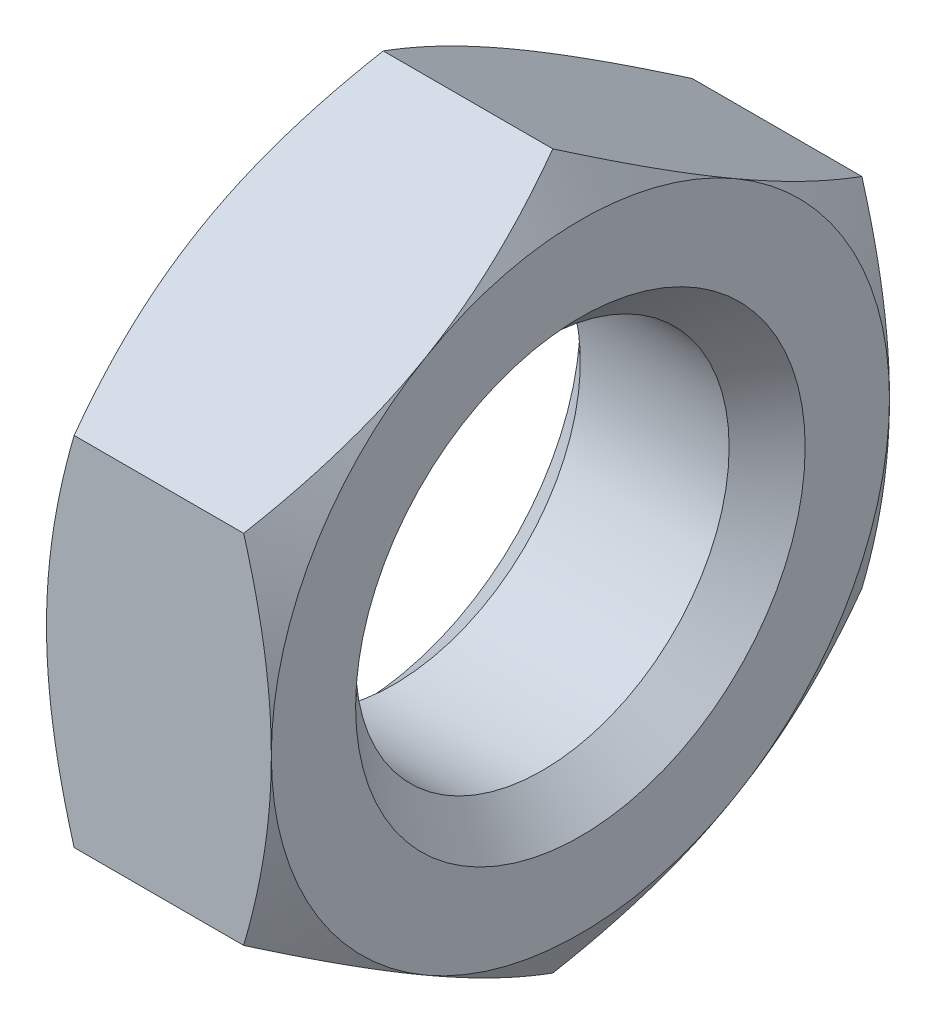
ISO-10303-21;
HEADER;
FILE_DESCRIPTION(('STEP AP214'),'2;1');
FILE_NAME('part.step','',(''),(''),'','','');
FILE_SCHEMA(('AUTOMOTIVE_DESIGN { 1 0 10303 214 1 1 1 1 }'));
ENDSEC;
DATA;
#1=APPLICATION_CONTEXT('core data for automotive mechanical design processes');
#2=APPLICATION_PROTOCOL_DEFINITION('international standard','automotive_design',2000,#1);
#3=PRODUCT_CONTEXT('',#1,'mechanical');
#4=PRODUCT('Part','Part','',(#3));
#5=PRODUCT_RELATED_PRODUCT_CATEGORY('part','',(#4));
#6=PRODUCT_DEFINITION_FORMATION('','',#4);
#7=PRODUCT_DEFINITION_CONTEXT('part definition',#1,'design');
#8=PRODUCT_DEFINITION('design','',#6,#7);
#9=PRODUCT_DEFINITION_SHAPE('','',#8);
#10=(LENGTH_UNIT() NAMED_UNIT(*) SI_UNIT(.MILLI.,.METRE.));
#11=(NAMED_UNIT(*) PLANE_ANGLE_UNIT() SI_UNIT($,.RADIAN.));
#12=(NAMED_UNIT(*) SI_UNIT($,.STERADIAN.) SOLID_ANGLE_UNIT());
#13=UNCERTAINTY_MEASURE_WITH_UNIT(LENGTH_MEASURE(1.E-05),#10,'distance_accuracy_value','');
#14=(GEOMETRIC_REPRESENTATION_CONTEXT(3) GLOBAL_UNCERTAINTY_ASSIGNED_CONTEXT((#13)) GLOBAL_UNIT_ASSIGNED_CONTEXT((#10,
#11,#12)) REPRESENTATION_CONTEXT('',''));
#15=CARTESIAN_POINT('',(0.,0.,0.));
#16=DIRECTION('',(0.,0.,1.));
#17=DIRECTION('',(1.,0.,0.));
#18=AXIS2_PLACEMENT_3D('',#15,#16,#17);
#19=CARTESIAN_POINT('',(2.,5.5,0.));
#20=DIRECTION('',(-1.,0.,0.));
#21=DIRECTION('',(0.,0.,1.));
#22=AXIS2_PLACEMENT_3D('',#19,#20,#21);
#23=PLANE('',#22);
#24=CARTESIAN_POINT('',(2.00000000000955,0.,0.));
#25=DIRECTION('',(1.,0.,0.));
#26=DIRECTION('',(0.,0.,-1.));
#27=AXIS2_PLACEMENT_3D('',#24,#25,#26);
#28=CIRCLE('',#27,3.99999999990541);
#29=CARTESIAN_POINT('',(2.00000000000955,0.,-3.99999999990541));
#30=VERTEX_POINT('',#29);
#31=EDGE_CURVE('E126',#30,#30,#28,.F.);
#32=ORIENTED_EDGE('',*,*,#31,.T.);
#33=EDGE_LOOP('',(#32));
#34=FACE_BOUND('',#33,.T.);
#35=CARTESIAN_POINT('',(2.00000000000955,0.,0.));
#36=DIRECTION('',(-1.,0.,0.));
#37=DIRECTION('',(0.,0.,1.));
#38=AXIS2_PLACEMENT_3D('',#35,#36,#37);
#39=CIRCLE('',#38,5.49999999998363);
#40=CARTESIAN_POINT('',(2.00000000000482,-4.76313972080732,2.7499999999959));
#41=VERTEX_POINT('',#40);
#42=CARTESIAN_POINT('',(2.00000000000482,0.,5.49999999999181));
#43=VERTEX_POINT('',#42);
#44=EDGE_CURVE('E129',#41,#43,#39,.T.);
#45=ORIENTED_EDGE('',*,*,#44,.F.);
#46=CARTESIAN_POINT('',(2.00000000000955,0.,0.));
#47=DIRECTION('',(-1.,0.,0.));
#48=DIRECTION('',(0.,0.,1.));
#49=AXIS2_PLACEMENT_3D('',#46,#47,#48);
#50=CIRCLE('',#49,5.49999999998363);
#51=CARTESIAN_POINT('',(2.00000000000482,-4.76313972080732,-2.74999999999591));
#52=VERTEX_POINT('',#51);
#53=EDGE_CURVE('E20',#52,#41,#50,.T.);
#54=ORIENTED_EDGE('',*,*,#53,.F.);
#55=CARTESIAN_POINT('',(2.00000000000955,0.,0.));
#56=DIRECTION('',(-1.,0.,0.));
#57=DIRECTION('',(0.,0.,1.));
#58=AXIS2_PLACEMENT_3D('',#55,#56,#57);
#59=CIRCLE('',#58,5.49999999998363);
#60=CARTESIAN_POINT('',(2.00000000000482,0.,-5.49999999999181));
#61=VERTEX_POINT('',#60);
#62=EDGE_CURVE('E104',#61,#52,#59,.T.);
#63=ORIENTED_EDGE('',*,*,#62,.F.);
#64=CARTESIAN_POINT('',(2.00000000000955,0.,0.));
#65=DIRECTION('',(-1.,0.,0.));
#66=DIRECTION('',(0.,0.,1.));
#67=AXIS2_PLACEMENT_3D('',#64,#65,#66);
#68=CIRCLE('',#67,5.49999999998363);
#69=CARTESIAN_POINT('',(2.00000000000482,4.76313972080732,-2.74999999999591));
#70=VERTEX_POINT('',#69);
#71=EDGE_CURVE('E424',#70,#61,#68,.T.);
#72=ORIENTED_EDGE('',*,*,#71,.F.);
#73=CARTESIAN_POINT('',(2.00000000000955,0.,0.));
#74=DIRECTION('',(-1.,0.,0.));
#75=DIRECTION('',(0.,0.,1.));
#76=AXIS2_PLACEMENT_3D('',#73,#74,#75);
#77=CIRCLE('',#76,5.49999999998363);
#78=CARTESIAN_POINT('',(2.00000000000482,4.76313972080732,2.74999999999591));
#79=VERTEX_POINT('',#78);
#80=EDGE_CURVE('E136',#79,#70,#77,.T.);
#81=ORIENTED_EDGE('',*,*,#80,.F.);
#82=CARTESIAN_POINT('',(2.00000000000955,0.,0.));
#83=DIRECTION('',(-1.,0.,0.));
#84=DIRECTION('',(0.,0.,1.));
#85=AXIS2_PLACEMENT_3D('',#82,#83,#84);
#86=CIRCLE('',#85,5.49999999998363);
#87=EDGE_CURVE('E131',#43,#79,#86,.T.);
#88=ORIENTED_EDGE('',*,*,#87,.F.);
#89=EDGE_LOOP('',(#45,#54,#63,#72,#81,#88));
#90=FACE_BOUND('',#89,.T.);
#91=ADVANCED_FACE('F17',(#34,#90),#23,.F.);
#92=CARTESIAN_POINT('',(1.50581237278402,0.,0.));
#93=DIRECTION('',(-1.,0.,0.));
#94=DIRECTION('',(0.,0.,1.));
#95=AXIS2_PLACEMENT_3D('',#92,#93,#94);
#96=CONICAL_SURFACE('',#95,6.35595807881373,1.04719755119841);
#97=ORIENTED_EDGE('',*,*,#53,.T.);
#98=CARTESIAN_POINT('',(1.50875981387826,-6.35085296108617,-4.9636607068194E-13));
#99=CARTESIAN_POINT('',(1.58339480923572,-6.22161377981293,0.223848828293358));
#100=CARTESIAN_POINT('',(1.65177349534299,-6.0913396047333,0.449490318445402));
#101=CARTESIAN_POINT('',(1.77235807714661,-5.82964290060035,0.902762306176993));
#102=CARTESIAN_POINT('',(1.82464394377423,-5.69822949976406,1.13037699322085));
#103=CARTESIAN_POINT('',(1.88884211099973,-5.49986917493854,1.47394715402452));
#104=CARTESIAN_POINT('',(1.90787752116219,-5.43349849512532,1.5889045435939));
#105=CARTESIAN_POINT('',(1.94082821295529,-5.30043939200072,1.81936967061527));
#106=CARTESIAN_POINT('',(1.95474362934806,-5.23375097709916,1.934877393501));
#107=CARTESIAN_POINT('',(1.9772098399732,-5.09980973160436,2.16687043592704));
#108=CARTESIAN_POINT('',(1.98573335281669,-5.03255574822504,2.28335775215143));
#109=CARTESIAN_POINT('',(1.99714023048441,-4.89791551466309,2.51656147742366));
#110=CARTESIAN_POINT('',(2.00002247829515,-4.83052924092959,2.63327792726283));
#111=CARTESIAN_POINT('',(2.0000000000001,-4.76313972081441,2.75));
#112=B_SPLINE_CURVE_WITH_KNOTS('',3,(#98,#99,#100,#101,#102,#103,#104,#105,#106,#107,#108,#109,
#110,#111),.UNSPECIFIED.,.F.,.F.,(4,2,2,2,2,2,4),(0.,0.80744032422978,1.61080087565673,
2.01300823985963,2.41520501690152,2.81942084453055,3.22371670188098),.UNSPECIFIED.);
#113=CARTESIAN_POINT('',(1.50875981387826,-6.35085296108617,0.));
#114=VERTEX_POINT('',#113);
#115=EDGE_CURVE('E113',#114,#41,#112,.T.);
#116=ORIENTED_EDGE('',*,*,#115,.F.);
#117=CARTESIAN_POINT('',(2.0000000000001,-4.76313972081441,-2.75));
#118=CARTESIAN_POINT('',(2.00002247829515,-4.83052924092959,-2.63327792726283));
#119=CARTESIAN_POINT('',(1.99714023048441,-4.89791551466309,-2.51656147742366));
#120=CARTESIAN_POINT('',(1.98573335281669,-5.03255574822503,-2.28335775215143));
#121=CARTESIAN_POINT('',(1.9772098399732,-5.09980973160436,-2.16687043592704));
#122=CARTESIAN_POINT('',(1.95474362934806,-5.23375097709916,-1.934877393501));
#123=CARTESIAN_POINT('',(1.94082821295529,-5.30043939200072,-1.81936967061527));
#124=CARTESIAN_POINT('',(1.90787752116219,-5.43349849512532,-1.5889045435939));
#125=CARTESIAN_POINT('',(1.88884211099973,-5.49986917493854,-1.47394715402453));
#126=CARTESIAN_POINT('',(1.82464394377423,-5.69822949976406,-1.13037699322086));
#127=CARTESIAN_POINT('',(1.77235807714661,-5.82964290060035,-0.902762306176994));
#128=CARTESIAN_POINT('',(1.65177349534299,-6.0913396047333,-0.449490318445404));
#129=CARTESIAN_POINT('',(1.58339480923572,-6.22161377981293,-0.22384882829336));
#130=CARTESIAN_POINT('',(1.50875981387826,-6.35085296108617,4.95414001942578E-13));
#131=B_SPLINE_CURVE_WITH_KNOTS('',3,(#117,#118,#119,#120,#121,#122,#123,#124,#125,#126,#127,
#128,#129,#130),.UNSPECIFIED.,.F.,.F.,(4,2,2,2,2,2,4),(0.,0.404295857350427,0.808511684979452,
1.21070846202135,1.61291582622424,2.4162763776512,3.22371670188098),.UNSPECIFIED.);
#132=EDGE_CURVE('E115',#52,#114,#131,.T.);
#133=ORIENTED_EDGE('',*,*,#132,.F.);
#134=EDGE_LOOP('',(#97,#116,#133));
#135=FACE_BOUND('',#134,.T.);
#136=ADVANCED_FACE('F112',(#135),#96,.T.);
#137=CARTESIAN_POINT('',(1.50581237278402,0.,0.));
#138=DIRECTION('',(-1.,0.,0.));
#139=DIRECTION('',(0.,0.,1.));
#140=AXIS2_PLACEMENT_3D('',#137,#138,#139);
#141=CONICAL_SURFACE('',#140,6.35595807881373,1.04719755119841);
#142=ORIENTED_EDGE('',*,*,#62,.T.);
#143=CARTESIAN_POINT('',(1.50875981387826,-3.17542648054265,-5.5000000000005));
#144=CARTESIAN_POINT('',(1.58339480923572,-3.30466566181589,-5.27615117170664));
#145=CARTESIAN_POINT('',(1.65177349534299,-3.43493983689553,-5.0505096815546));
#146=CARTESIAN_POINT('',(1.77235807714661,-3.69663654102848,-4.59723769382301));
#147=CARTESIAN_POINT('',(1.82464394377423,-3.82804994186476,-4.36962300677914));
#148=CARTESIAN_POINT('',(1.88884211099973,-4.02641026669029,-4.02605284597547));
#149=CARTESIAN_POINT('',(1.90787752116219,-4.0927809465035,-3.9110954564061));
#150=CARTESIAN_POINT('',(1.94082821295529,-4.22584004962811,-3.68063032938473));
#151=CARTESIAN_POINT('',(1.95474362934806,-4.29252846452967,-3.565122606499));
#152=CARTESIAN_POINT('',(1.9772098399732,-4.42646971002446,-3.33312956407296));
#153=CARTESIAN_POINT('',(1.98573335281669,-4.49372369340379,-3.21664224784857));
#154=CARTESIAN_POINT('',(1.99714023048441,-4.62836392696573,-2.98343852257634));
#155=CARTESIAN_POINT('',(2.00002247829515,-4.69575020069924,-2.86672207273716));
#156=CARTESIAN_POINT('',(2.0000000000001,-4.76313972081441,-2.75));
#157=B_SPLINE_CURVE_WITH_KNOTS('',3,(#143,#144,#145,#146,#147,#148,#149,#150,#151,#152,#153,
#154,#155,#156),.UNSPECIFIED.,.F.,.F.,(4,2,2,2,2,2,4),(0.,0.807440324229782,1.61080087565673,
2.01300823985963,2.41520501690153,2.81942084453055,3.22371670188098),.UNSPECIFIED.);
#158=CARTESIAN_POINT('',(1.50875981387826,-3.17542648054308,-5.50000000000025));
#159=VERTEX_POINT('',#158);
#160=EDGE_CURVE('E140',#159,#52,#157,.T.);
#161=ORIENTED_EDGE('',*,*,#160,.F.);
#162=CARTESIAN_POINT('',(2.0000000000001,0.,-5.5));
#163=CARTESIAN_POINT('',(2.00002247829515,-0.134779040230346,-5.5));
#164=CARTESIAN_POINT('',(1.99714023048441,-0.269551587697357,-5.5));
#165=CARTESIAN_POINT('',(1.98573335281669,-0.538832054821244,-5.5));
#166=CARTESIAN_POINT('',(1.9772098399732,-0.673340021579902,-5.5));
#167=CARTESIAN_POINT('',(1.95474362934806,-0.941222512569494,-5.5));
#168=CARTESIAN_POINT('',(1.94082821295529,-1.07459934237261,-5.5));
#169=CARTESIAN_POINT('',(1.90787752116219,-1.34071754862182,-5.5));
#170=CARTESIAN_POINT('',(1.88884211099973,-1.47345890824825,-5.5));
#171=CARTESIAN_POINT('',(1.82464394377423,-1.8701795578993,-5.5));
#172=CARTESIAN_POINT('',(1.77235807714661,-2.13300635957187,-5.5));
#173=CARTESIAN_POINT('',(1.65177349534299,-2.65639976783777,-5.5));
#174=CARTESIAN_POINT('',(1.58339480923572,-2.91694811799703,-5.5));
#175=CARTESIAN_POINT('',(1.50875981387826,-3.17542648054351,-5.5));
#176=B_SPLINE_CURVE_WITH_KNOTS('',3,(#162,#163,#164,#165,#166,#167,#168,#169,#170,#171,#172,
#173,#174,#175),.UNSPECIFIED.,.F.,.F.,(4,2,2,2,2,2,4),(0.,0.404295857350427,0.808511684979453,
1.21070846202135,1.61291582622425,2.4162763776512,3.22371670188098),.UNSPECIFIED.);
#177=EDGE_CURVE('E294',#61,#159,#176,.T.);
#178=ORIENTED_EDGE('',*,*,#177,.F.);
#179=EDGE_LOOP('',(#142,#161,#178));
#180=FACE_BOUND('',#179,.T.);
#181=ADVANCED_FACE('F284',(#180),#141,.T.);
#182=CARTESIAN_POINT('',(1.50581237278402,0.,0.));
#183=DIRECTION('',(-1.,0.,0.));
#184=DIRECTION('',(0.,0.,1.));
#185=AXIS2_PLACEMENT_3D('',#182,#183,#184);
#186=CONICAL_SURFACE('',#185,6.35595807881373,1.04719755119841);
#187=ORIENTED_EDGE('',*,*,#71,.T.);
#188=CARTESIAN_POINT('',(1.50875981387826,3.17542648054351,-5.5));
#189=CARTESIAN_POINT('',(1.58339480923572,2.91694811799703,-5.5));
#190=CARTESIAN_POINT('',(1.65177349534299,2.65639976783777,-5.5));
#191=CARTESIAN_POINT('',(1.77235807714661,2.13300635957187,-5.5));
#192=CARTESIAN_POINT('',(1.82464394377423,1.8701795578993,-5.5));
#193=CARTESIAN_POINT('',(1.88884211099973,1.47345890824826,-5.5));
#194=CARTESIAN_POINT('',(1.90787752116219,1.34071754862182,-5.5));
#195=CARTESIAN_POINT('',(1.94082821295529,1.07459934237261,-5.5));
#196=CARTESIAN_POINT('',(1.95474362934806,0.941222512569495,-5.5));
#197=CARTESIAN_POINT('',(1.9772098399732,0.673340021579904,-5.5));
#198=CARTESIAN_POINT('',(1.98573335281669,0.538832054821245,-5.5));
#199=CARTESIAN_POINT('',(1.99714023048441,0.269551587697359,-5.5));
#200=CARTESIAN_POINT('',(2.00002247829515,0.134779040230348,-5.5));
#201=CARTESIAN_POINT('',(2.0000000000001,0.,-5.5));
#202=B_SPLINE_CURVE_WITH_KNOTS('',3,(#188,#189,#190,#191,#192,#193,#194,#195,#196,#197,#198,
#199,#200,#201),.UNSPECIFIED.,.F.,.F.,(4,2,2,2,2,2,4),(0.,0.807440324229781,1.61080087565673,
2.01300823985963,2.41520501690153,2.81942084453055,3.22371670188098),.UNSPECIFIED.);
#203=CARTESIAN_POINT('',(1.50875981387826,3.17542648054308,-5.50000000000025));
#204=VERTEX_POINT('',#203);
#205=EDGE_CURVE('E289',#204,#61,#202,.T.);
#206=ORIENTED_EDGE('',*,*,#205,.F.);
#207=CARTESIAN_POINT('',(2.0000000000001,4.76313972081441,-2.75));
#208=CARTESIAN_POINT('',(2.00002247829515,4.69575020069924,-2.86672207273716));
#209=CARTESIAN_POINT('',(1.99714023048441,4.62836392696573,-2.98343852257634));
#210=CARTESIAN_POINT('',(1.98573335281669,4.49372369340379,-3.21664224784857));
#211=CARTESIAN_POINT('',(1.9772098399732,4.42646971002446,-3.33312956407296));
#212=CARTESIAN_POINT('',(1.95474362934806,4.29252846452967,-3.565122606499));
#213=CARTESIAN_POINT('',(1.94082821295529,4.22584004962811,-3.68063032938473));
#214=CARTESIAN_POINT('',(1.90787752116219,4.0927809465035,-3.9110954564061));
#215=CARTESIAN_POINT('',(1.88884211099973,4.02641026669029,-4.02605284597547));
#216=CARTESIAN_POINT('',(1.82464394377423,3.82804994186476,-4.36962300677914));
#217=CARTESIAN_POINT('',(1.77235807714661,3.69663654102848,-4.59723769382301));
#218=CARTESIAN_POINT('',(1.65177349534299,3.43493983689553,-5.0505096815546));
#219=CARTESIAN_POINT('',(1.58339480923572,3.30466566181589,-5.27615117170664));
#220=CARTESIAN_POINT('',(1.50875981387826,3.17542648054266,-5.5000000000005));
#221=B_SPLINE_CURVE_WITH_KNOTS('',3,(#207,#208,#209,#210,#211,#212,#213,#214,#215,#216,#217,
#218,#219,#220),.UNSPECIFIED.,.F.,.F.,(4,2,2,2,2,2,4),(0.,0.404295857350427,0.808511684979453,
1.21070846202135,1.61291582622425,2.4162763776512,3.22371670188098),.UNSPECIFIED.);
#222=EDGE_CURVE('E267',#70,#204,#221,.T.);
#223=ORIENTED_EDGE('',*,*,#222,.F.);
#224=EDGE_LOOP('',(#187,#206,#223));
#225=FACE_BOUND('',#224,.T.);
#226=ADVANCED_FACE('F281',(#225),#186,.T.);
#227=CARTESIAN_POINT('',(1.50581237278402,0.,0.));
#228=DIRECTION('',(-1.,0.,0.));
#229=DIRECTION('',(0.,0.,1.));
#230=AXIS2_PLACEMENT_3D('',#227,#228,#229);
#231=CONICAL_SURFACE('',#230,6.35595807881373,1.04719755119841);
#232=ORIENTED_EDGE('',*,*,#80,.T.);
#233=CARTESIAN_POINT('',(1.50875981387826,6.35085296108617,4.96321849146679E-13));
#234=CARTESIAN_POINT('',(1.58339480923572,6.22161377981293,-0.223848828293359));
#235=CARTESIAN_POINT('',(1.65177349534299,6.0913396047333,-0.449490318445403));
#236=CARTESIAN_POINT('',(1.77235807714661,5.82964290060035,-0.902762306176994));
#237=CARTESIAN_POINT('',(1.82464394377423,5.69822949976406,-1.13037699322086));
#238=CARTESIAN_POINT('',(1.88884211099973,5.49986917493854,-1.47394715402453));
#239=CARTESIAN_POINT('',(1.90787752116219,5.43349849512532,-1.5889045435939));
#240=CARTESIAN_POINT('',(1.94082821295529,5.30043939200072,-1.81936967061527));
#241=CARTESIAN_POINT('',(1.95474362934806,5.23375097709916,-1.934877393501));
#242=CARTESIAN_POINT('',(1.9772098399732,5.09980973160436,-2.16687043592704));
#243=CARTESIAN_POINT('',(1.98573335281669,5.03255574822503,-2.28335775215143));
#244=CARTESIAN_POINT('',(1.99714023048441,4.89791551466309,-2.51656147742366));
#245=CARTESIAN_POINT('',(2.00002247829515,4.83052924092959,-2.63327792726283));
#246=CARTESIAN_POINT('',(2.0000000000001,4.76313972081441,-2.75));
#247=B_SPLINE_CURVE_WITH_KNOTS('',3,(#233,#234,#235,#236,#237,#238,#239,#240,#241,#242,#243,
#244,#245,#246),.UNSPECIFIED.,.F.,.F.,(4,2,2,2,2,2,4),(0.,0.807440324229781,1.61080087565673,
2.01300823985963,2.41520501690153,2.81942084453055,3.22371670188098),.UNSPECIFIED.);
#248=CARTESIAN_POINT('',(1.50875981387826,6.35085296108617,0.));
#249=VERTEX_POINT('',#248);
#250=EDGE_CURVE('E272',#249,#70,#247,.T.);
#251=ORIENTED_EDGE('',*,*,#250,.F.);
#252=CARTESIAN_POINT('',(2.0000000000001,4.76313972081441,2.75));
#253=CARTESIAN_POINT('',(2.00002247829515,4.83052924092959,2.63327792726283));
#254=CARTESIAN_POINT('',(1.99714023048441,4.89791551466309,2.51656147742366));
#255=CARTESIAN_POINT('',(1.98573335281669,5.03255574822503,2.28335775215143));
#256=CARTESIAN_POINT('',(1.9772098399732,5.09980973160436,2.16687043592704));
#257=CARTESIAN_POINT('',(1.95474362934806,5.23375097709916,1.934877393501));
#258=CARTESIAN_POINT('',(1.94082821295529,5.30043939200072,1.81936967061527));
#259=CARTESIAN_POINT('',(1.90787752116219,5.43349849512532,1.5889045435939));
#260=CARTESIAN_POINT('',(1.88884211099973,5.49986917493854,1.47394715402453));
#261=CARTESIAN_POINT('',(1.82464394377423,5.69822949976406,1.13037699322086));
#262=CARTESIAN_POINT('',(1.77235807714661,5.82964290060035,0.902762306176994));
#263=CARTESIAN_POINT('',(1.65177349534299,6.0913396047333,0.449490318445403));
#264=CARTESIAN_POINT('',(1.58339480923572,6.22161377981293,0.223848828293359));
#265=CARTESIAN_POINT('',(1.50875981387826,6.35085296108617,-4.9570591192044E-13));
#266=B_SPLINE_CURVE_WITH_KNOTS('',3,(#252,#253,#254,#255,#256,#257,#258,#259,#260,#261,#262,
#263,#264,#265),.UNSPECIFIED.,.F.,.F.,(4,2,2,2,2,2,4),(0.,0.404295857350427,0.808511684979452,
1.21070846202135,1.61291582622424,2.4162763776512,3.22371670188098),.UNSPECIFIED.);
#267=EDGE_CURVE('E183',#79,#249,#266,.T.);
#268=ORIENTED_EDGE('',*,*,#267,.F.);
#269=EDGE_LOOP('',(#232,#251,#268));
#270=FACE_BOUND('',#269,.T.);
#271=ADVANCED_FACE('F165',(#270),#231,.T.);
#272=CARTESIAN_POINT('',(1.50581237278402,0.,0.));
#273=DIRECTION('',(-1.,0.,0.));
#274=DIRECTION('',(0.,0.,1.));
#275=AXIS2_PLACEMENT_3D('',#272,#273,#274);
#276=CONICAL_SURFACE('',#275,6.35595807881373,1.04719755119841);
#277=ORIENTED_EDGE('',*,*,#44,.T.);
#278=CARTESIAN_POINT('',(1.50875981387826,-3.17542648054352,5.5));
#279=CARTESIAN_POINT('',(1.58339480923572,-2.91694811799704,5.5));
#280=CARTESIAN_POINT('',(1.65177349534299,-2.65639976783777,5.5));
#281=CARTESIAN_POINT('',(1.77235807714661,-2.13300635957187,5.5));
#282=CARTESIAN_POINT('',(1.82464394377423,-1.8701795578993,5.5));
#283=CARTESIAN_POINT('',(1.88884211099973,-1.47345890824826,5.5));
#284=CARTESIAN_POINT('',(1.90787752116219,-1.34071754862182,5.5));
#285=CARTESIAN_POINT('',(1.94082821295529,-1.07459934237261,5.5));
#286=CARTESIAN_POINT('',(1.95474362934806,-0.941222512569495,5.5));
#287=CARTESIAN_POINT('',(1.9772098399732,-0.673340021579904,5.5));
#288=CARTESIAN_POINT('',(1.98573335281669,-0.538832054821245,5.5));
#289=CARTESIAN_POINT('',(1.99714023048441,-0.269551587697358,5.5));
#290=CARTESIAN_POINT('',(2.00002247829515,-0.134779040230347,5.5));
#291=CARTESIAN_POINT('',(2.0000000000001,0.,5.5));
#292=B_SPLINE_CURVE_WITH_KNOTS('',3,(#278,#279,#280,#281,#282,#283,#284,#285,#286,#287,#288,
#289,#290,#291),.UNSPECIFIED.,.F.,.F.,(4,2,2,2,2,2,4),(0.,0.807440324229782,1.61080087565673,
2.01300823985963,2.41520501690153,2.81942084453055,3.22371670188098),.UNSPECIFIED.);
#293=CARTESIAN_POINT('',(1.50875981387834,-3.1754264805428,5.50000000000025));
#294=VERTEX_POINT('',#293);
#295=EDGE_CURVE('E139',#294,#43,#292,.T.);
#296=ORIENTED_EDGE('',*,*,#295,.F.);
#297=CARTESIAN_POINT('',(2.0000000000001,-4.76313972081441,2.75));
#298=CARTESIAN_POINT('',(2.00002247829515,-4.69575020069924,2.86672207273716));
#299=CARTESIAN_POINT('',(1.99714023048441,-4.62836392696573,2.98343852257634));
#300=CARTESIAN_POINT('',(1.98573335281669,-4.49372369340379,3.21664224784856));
#301=CARTESIAN_POINT('',(1.9772098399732,-4.42646971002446,3.33312956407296));
#302=CARTESIAN_POINT('',(1.95474362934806,-4.29252846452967,3.565122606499));
#303=CARTESIAN_POINT('',(1.94082821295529,-4.22584004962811,3.68063032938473));
#304=CARTESIAN_POINT('',(1.90787752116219,-4.0927809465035,3.9110954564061));
#305=CARTESIAN_POINT('',(1.88884211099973,-4.02641026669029,4.02605284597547));
#306=CARTESIAN_POINT('',(1.82464394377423,-3.82804994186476,4.36962300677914));
#307=CARTESIAN_POINT('',(1.77235807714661,-3.69663654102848,4.59723769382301));
#308=CARTESIAN_POINT('',(1.65177349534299,-3.43493983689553,5.05050968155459));
#309=CARTESIAN_POINT('',(1.58339480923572,-3.30466566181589,5.27615117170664));
#310=CARTESIAN_POINT('',(1.50875981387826,-3.17542648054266,5.50000000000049));
#311=B_SPLINE_CURVE_WITH_KNOTS('',3,(#297,#298,#299,#300,#301,#302,#303,#304,#305,#306,#307,
#308,#309,#310),.UNSPECIFIED.,.F.,.F.,(4,2,2,2,2,2,4),(0.,0.404295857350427,0.808511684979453,
1.21070846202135,1.61291582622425,2.4162763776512,3.22371670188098),.UNSPECIFIED.);
#312=EDGE_CURVE('E122',#41,#294,#311,.T.);
#313=ORIENTED_EDGE('',*,*,#312,.F.);
#314=EDGE_LOOP('',(#277,#296,#313));
#315=FACE_BOUND('',#314,.T.);
#316=ADVANCED_FACE('F138',(#315),#276,.T.);
#317=CARTESIAN_POINT('',(1.50581237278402,0.,0.));
#318=DIRECTION('',(-1.,0.,0.));
#319=DIRECTION('',(0.,0.,1.));
#320=AXIS2_PLACEMENT_3D('',#317,#318,#319);
#321=CONICAL_SURFACE('',#320,6.35595807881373,1.04719755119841);
#322=CARTESIAN_POINT('',(2.0000000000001,0.,5.5));
#323=CARTESIAN_POINT('',(2.00002247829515,0.134779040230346,5.5));
#324=CARTESIAN_POINT('',(1.99714023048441,0.269551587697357,5.5));
#325=CARTESIAN_POINT('',(1.98573335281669,0.538832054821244,5.5));
#326=CARTESIAN_POINT('',(1.9772098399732,0.673340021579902,5.5));
#327=CARTESIAN_POINT('',(1.95474362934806,0.941222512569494,5.5));
#328=CARTESIAN_POINT('',(1.94082821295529,1.07459934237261,5.5));
#329=CARTESIAN_POINT('',(1.90787752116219,1.34071754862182,5.5));
#330=CARTESIAN_POINT('',(1.88884211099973,1.47345890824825,5.5));
#331=CARTESIAN_POINT('',(1.82464394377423,1.8701795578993,5.5));
#332=CARTESIAN_POINT('',(1.77235807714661,2.13300635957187,5.5));
#333=CARTESIAN_POINT('',(1.65177349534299,2.65639976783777,5.5));
#334=CARTESIAN_POINT('',(1.58339480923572,2.91694811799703,5.5));
#335=CARTESIAN_POINT('',(1.50875981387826,3.17542648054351,5.5));
#336=B_SPLINE_CURVE_WITH_KNOTS('',3,(#322,#323,#324,#325,#326,#327,#328,#329,#330,#331,#332,
#333,#334,#335),.UNSPECIFIED.,.F.,.F.,(4,2,2,2,2,2,4),(0.,0.404295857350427,0.808511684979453,
1.21070846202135,1.61291582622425,2.4162763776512,3.22371670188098),.UNSPECIFIED.);
#337=CARTESIAN_POINT('',(1.50875981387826,3.17542648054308,5.50000000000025));
#338=VERTEX_POINT('',#337);
#339=EDGE_CURVE('E177',#43,#338,#336,.T.);
#340=ORIENTED_EDGE('',*,*,#339,.F.);
#341=ORIENTED_EDGE('',*,*,#87,.T.);
#342=CARTESIAN_POINT('',(1.50875981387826,3.17542648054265,5.5000000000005));
#343=CARTESIAN_POINT('',(1.58339480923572,3.3046656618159,5.27615117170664));
#344=CARTESIAN_POINT('',(1.65177349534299,3.43493983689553,5.0505096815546));
#345=CARTESIAN_POINT('',(1.77235807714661,3.69663654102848,4.59723769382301));
#346=CARTESIAN_POINT('',(1.82464394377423,3.82804994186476,4.36962300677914));
#347=CARTESIAN_POINT('',(1.88884211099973,4.02641026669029,4.02605284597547));
#348=CARTESIAN_POINT('',(1.90787752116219,4.0927809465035,3.9110954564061));
#349=CARTESIAN_POINT('',(1.94082821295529,4.22584004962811,3.68063032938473));
#350=CARTESIAN_POINT('',(1.95474362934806,4.29252846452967,3.565122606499));
#351=CARTESIAN_POINT('',(1.9772098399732,4.42646971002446,3.33312956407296));
#352=CARTESIAN_POINT('',(1.98573335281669,4.49372369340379,3.21664224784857));
#353=CARTESIAN_POINT('',(1.99714023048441,4.62836392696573,2.98343852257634));
#354=CARTESIAN_POINT('',(2.00002247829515,4.69575020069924,2.86672207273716));
#355=CARTESIAN_POINT('',(2.0000000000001,4.76313972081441,2.75));
#356=B_SPLINE_CURVE_WITH_KNOTS('',3,(#342,#343,#344,#345,#346,#347,#348,#349,#350,#351,#352,
#353,#354,#355),.UNSPECIFIED.,.F.,.F.,(4,2,2,2,2,2,4),(0.,0.807440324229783,1.61080087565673,
2.01300823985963,2.41520501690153,2.81942084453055,3.22371670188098),.UNSPECIFIED.);
#357=EDGE_CURVE('E273',#338,#79,#356,.T.);
#358=ORIENTED_EDGE('',*,*,#357,.F.);
#359=EDGE_LOOP('',(#340,#341,#358));
#360=FACE_BOUND('',#359,.T.);
#361=ADVANCED_FACE('F164',(#360),#321,.T.);
#362=CARTESIAN_POINT('',(2.00000000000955,0.,0.));
#363=DIRECTION('',(1.,0.,0.));
#364=DIRECTION('',(0.,0.,-1.));
#365=AXIS2_PLACEMENT_3D('',#362,#363,#364);
#366=CONICAL_SURFACE('',#365,3.99999999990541,0.785398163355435);
#367=CARTESIAN_POINT('',(1.3235,0.,0.));
#368=DIRECTION('',(-1.,0.,0.));
#369=DIRECTION('',(0.,0.,1.));
#370=AXIS2_PLACEMENT_3D('',#367,#368,#369);
#371=CIRCLE('',#370,3.3235);
#372=CARTESIAN_POINT('',(1.3235,0.,3.3235));
#373=VERTEX_POINT('',#372);
#374=EDGE_CURVE('E358',#373,#373,#371,.T.);
#375=ORIENTED_EDGE('',*,*,#374,.T.);
#376=EDGE_LOOP('',(#375));
#377=FACE_BOUND('',#376,.T.);
#378=ORIENTED_EDGE('',*,*,#31,.F.);
#379=EDGE_LOOP('',(#378));
#380=FACE_BOUND('',#379,.T.);
#381=ADVANCED_FACE('F436',(#377,#380),#366,.F.);
#382=CARTESIAN_POINT('',(-2.,-3.17542648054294,5.5));
#383=DIRECTION('',(0.,-0.866025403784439,0.5));
#384=DIRECTION('',(0.,-0.5,-0.866025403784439));
#385=AXIS2_PLACEMENT_3D('',#382,#383,#384);
#386=PLANE('',#385);
#387=ORIENTED_EDGE('',*,*,#312,.T.);
#388=DIRECTION('',(1.,0.,0.));
#389=VECTOR('',#388,1.);
#390=CARTESIAN_POINT('',(-2.,-3.17542648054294,5.5));
#391=LINE('',#390,#389);
#392=CARTESIAN_POINT('',(-1.50875982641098,-3.17542650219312,5.4999999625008));
#393=VERTEX_POINT('',#392);
#394=EDGE_CURVE('E178',#393,#294,#391,.T.);
#395=ORIENTED_EDGE('',*,*,#394,.F.);
#396=CARTESIAN_POINT('',(-2.00000000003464,-4.763139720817,2.75000000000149));
#397=CARTESIAN_POINT('',(-2.00002247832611,-4.6957502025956,2.86672206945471));
#398=CARTESIAN_POINT('',(-1.99714023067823,-4.6283639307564,2.98343851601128));
#399=CARTESIAN_POINT('',(-1.98573335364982,-4.49372370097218,3.21664223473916));
#400=CARTESIAN_POINT('',(-1.97720984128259,-4.42646971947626,3.3331295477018));
#401=CARTESIAN_POINT('',(-1.95474363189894,-4.29252847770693,3.56512258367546));
#402=CARTESIAN_POINT('',(-1.94082821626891,-4.22584006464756,3.68063030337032));
#403=CARTESIAN_POINT('',(-1.90787752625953,-4.09278096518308,3.91109542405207));
#404=CARTESIAN_POINT('',(-1.8888421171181,-4.02641028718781,4.0260528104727));
#405=CARTESIAN_POINT('',(-1.82464395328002,-3.82804996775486,4.36962296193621));
#406=CARTESIAN_POINT('',(-1.77235808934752,-3.69663657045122,4.59723764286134));
#407=CARTESIAN_POINT('',(-1.65177351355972,-3.43493987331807,5.05050961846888));
#408=CARTESIAN_POINT('',(-1.58339483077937,-3.30466570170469,5.27615110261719));
#409=CARTESIAN_POINT('',(-1.50875983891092,-3.17542652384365,5.49999992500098));
#410=B_SPLINE_CURVE_WITH_KNOTS('',3,(#396,#397,#398,#399,#400,#401,#402,#403,#404,#405,#406,
#407,#408,#409),.UNSPECIFIED.,.F.,.F.,(4,2,2,2,2,2,4),(0.,0.404295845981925,0.808511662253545,
1.21070842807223,1.61291578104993,2.41627631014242,3.22371661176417),.UNSPECIFIED.);
#411=CARTESIAN_POINT('',(-2.00000000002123,-4.76313972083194,2.75000000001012));
#412=VERTEX_POINT('',#411);
#413=EDGE_CURVE('E367',#412,#393,#410,.T.);
#414=ORIENTED_EDGE('',*,*,#413,.F.);
#415=CARTESIAN_POINT('',(-1.50875980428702,-6.35085297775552,-2.88726586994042E-08));
#416=CARTESIAN_POINT('',(-1.58339480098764,-6.22161379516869,0.223848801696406));
#417=CARTESIAN_POINT('',(-1.65177348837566,-6.09133961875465,0.449490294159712));
#418=CARTESIAN_POINT('',(-1.77235807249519,-5.82964291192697,0.902762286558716));
#419=CARTESIAN_POINT('',(-1.82464394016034,-5.69822950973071,1.13037697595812));
#420=CARTESIAN_POINT('',(-1.88884210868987,-5.49986918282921,1.47394714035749));
#421=CARTESIAN_POINT('',(-1.90787751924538,-5.43349850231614,1.58890453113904));
#422=CARTESIAN_POINT('',(-1.94082821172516,-5.30043939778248,1.81936966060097));
#423=CARTESIAN_POINT('',(-1.95474362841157,-5.23375098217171,1.93487738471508));
#424=CARTESIAN_POINT('',(-1.9772098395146,-5.09980973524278,2.16687042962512));
#425=CARTESIAN_POINT('',(-1.98573335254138,-5.03255575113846,2.28335774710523));
#426=CARTESIAN_POINT('',(-1.99714023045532,-4.89791551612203,2.51656147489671));
#427=CARTESIAN_POINT('',(-2.00002247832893,-4.83052924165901,2.63327792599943));
#428=CARTESIAN_POINT('',(-2.00000000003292,-4.76313972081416,2.75000000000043));
#429=B_SPLINE_CURVE_WITH_KNOTS('',3,(#415,#416,#417,#418,#419,#420,#421,#422,#423,#424,#425,
#426,#427,#428),.UNSPECIFIED.,.F.,.F.,(4,2,2,2,2,2,4),(0.,0.807440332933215,1.61080089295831,
2.01300826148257,2.41520504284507,2.81942087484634,3.22371673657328),.UNSPECIFIED.);
#430=CARTESIAN_POINT('',(-1.50875982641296,-6.35085293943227,-3.75051495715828E-08));
#431=VERTEX_POINT('',#430);
#432=EDGE_CURVE('E403',#431,#412,#429,.T.);
#433=ORIENTED_EDGE('',*,*,#432,.F.);
#434=DIRECTION('',(1.,0.,0.));
#435=VECTOR('',#434,1.);
#436=CARTESIAN_POINT('',(-2.,-6.35085296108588,0.));
#437=LINE('',#436,#435);
#438=EDGE_CURVE('E125',#114,#431,#437,.F.);
#439=ORIENTED_EDGE('',*,*,#438,.F.);
#440=ORIENTED_EDGE('',*,*,#115,.T.);
#441=EDGE_LOOP('',(#387,#395,#414,#433,#439,#440));
#442=FACE_BOUND('',#441,.T.);
#443=ADVANCED_FACE('F119',(#442),#386,.T.);
#444=CARTESIAN_POINT('',(-2.,-6.35085296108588,0.));
#445=DIRECTION('',(0.,-0.866025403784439,-0.5));
#446=DIRECTION('',(0.,0.5,-0.866025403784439));
#447=AXIS2_PLACEMENT_3D('',#444,#445,#446);
#448=PLANE('',#447);
#449=ORIENTED_EDGE('',*,*,#132,.T.);
#450=ORIENTED_EDGE('',*,*,#438,.T.);
#451=CARTESIAN_POINT('',(-2.00000000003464,-4.763139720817,-2.75000000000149));
#452=CARTESIAN_POINT('',(-2.00002247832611,-4.8305292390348,-2.63327793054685));
#453=CARTESIAN_POINT('',(-1.99714023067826,-4.89791551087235,-2.51656148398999));
#454=CARTESIAN_POINT('',(-1.98573335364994,-5.03255574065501,-2.28335776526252));
#455=CARTESIAN_POINT('',(-1.97720984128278,-5.09980972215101,-2.16687045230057));
#456=CARTESIAN_POINT('',(-1.95474363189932,-5.23375096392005,-1.93487741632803));
#457=CARTESIAN_POINT('',(-1.9408282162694,-5.30043937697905,-1.8193696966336));
#458=CARTESIAN_POINT('',(-1.90787752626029,-5.43349847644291,-1.58890457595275));
#459=CARTESIAN_POINT('',(-1.88884211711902,-5.49986915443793,-1.47394718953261));
#460=CARTESIAN_POINT('',(-1.82464395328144,-5.69822947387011,-1.13037703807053));
#461=CARTESIAN_POINT('',(-1.77235808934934,-5.82964287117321,-0.902762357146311));
#462=CARTESIAN_POINT('',(-1.65177351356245,-6.09133956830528,-0.449490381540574));
#463=CARTESIAN_POINT('',(-1.58339483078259,-6.22161373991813,-0.223848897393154));
#464=CARTESIAN_POINT('',(-1.50875983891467,-6.35085291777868,-7.50102675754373E-08));
#465=B_SPLINE_CURVE_WITH_KNOTS('',3,(#451,#452,#453,#454,#455,#456,#457,#458,#459,#460,#461,
#462,#463,#464),.UNSPECIFIED.,.F.,.F.,(4,2,2,2,2,2,4),(0.,0.40429584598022,0.808511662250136,
1.21070842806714,1.61291578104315,2.41627631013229,3.22371661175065),.UNSPECIFIED.);
#466=CARTESIAN_POINT('',(-2.00000000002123,-4.76313972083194,-2.75000000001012));
#467=VERTEX_POINT('',#466);
#468=EDGE_CURVE('E407',#467,#431,#465,.T.);
#469=ORIENTED_EDGE('',*,*,#468,.F.);
#470=CARTESIAN_POINT('',(-1.50875980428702,-3.17542646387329,-5.50000002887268));
#471=CARTESIAN_POINT('',(-1.58339480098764,-3.30466564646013,-5.27615119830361));
#472=CARTESIAN_POINT('',(-1.65177348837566,-3.43493982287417,-5.0505097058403));
#473=CARTESIAN_POINT('',(-1.77235807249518,-3.69663652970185,-4.5972377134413));
#474=CARTESIAN_POINT('',(-1.82464394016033,-3.82804993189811,-4.36962302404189));
#475=CARTESIAN_POINT('',(-1.88884210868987,-4.02641025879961,-4.02605285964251));
#476=CARTESIAN_POINT('',(-1.90787751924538,-4.09278093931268,-3.91109546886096));
#477=CARTESIAN_POINT('',(-1.94082821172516,-4.22584004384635,-3.68063033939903));
#478=CARTESIAN_POINT('',(-1.95474362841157,-4.29252845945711,-3.56512261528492));
#479=CARTESIAN_POINT('',(-1.9772098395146,-4.42646970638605,-3.33312957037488));
#480=CARTESIAN_POINT('',(-1.98573335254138,-4.49372369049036,-3.21664225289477));
#481=CARTESIAN_POINT('',(-1.99714023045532,-4.6283639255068,-2.98343852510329));
#482=CARTESIAN_POINT('',(-2.00002247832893,-4.69575019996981,-2.86672207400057));
#483=CARTESIAN_POINT('',(-2.00000000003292,-4.76313972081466,-2.74999999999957));
#484=B_SPLINE_CURVE_WITH_KNOTS('',3,(#470,#471,#472,#473,#474,#475,#476,#477,#478,#479,#480,
#481,#482,#483),.UNSPECIFIED.,.F.,.F.,(4,2,2,2,2,2,4),(0.,0.807440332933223,1.61080089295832,
2.01300826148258,2.41520504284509,2.81942087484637,3.22371673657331),.UNSPECIFIED.);
#485=CARTESIAN_POINT('',(-1.50875982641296,-3.17542643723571,-5.5));
#486=VERTEX_POINT('',#485);
#487=EDGE_CURVE('E377',#486,#467,#484,.T.);
#488=ORIENTED_EDGE('',*,*,#487,.F.);
#489=DIRECTION('',(-1.,0.,0.));
#490=VECTOR('',#489,1.);
#491=CARTESIAN_POINT('',(-2.,-3.17542648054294,-5.5));
#492=LINE('',#491,#490);
#493=EDGE_CURVE('E363',#159,#486,#492,.T.);
#494=ORIENTED_EDGE('',*,*,#493,.F.);
#495=ORIENTED_EDGE('',*,*,#160,.T.);
#496=EDGE_LOOP('',(#449,#450,#469,#488,#494,#495));
#497=FACE_BOUND('',#496,.T.);
#498=ADVANCED_FACE('F301',(#497),#448,.T.);
#499=CARTESIAN_POINT('',(-2.,-3.17542648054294,-5.5));
#500=DIRECTION('',(0.,0.,-1.));
#501=DIRECTION('',(-1.,0.,0.));
#502=AXIS2_PLACEMENT_3D('',#499,#500,#501);
#503=PLANE('',#502);
#504=ORIENTED_EDGE('',*,*,#177,.T.);
#505=ORIENTED_EDGE('',*,*,#493,.T.);
#506=CARTESIAN_POINT('',(-2.00000000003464,0.,-5.50000000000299));
#507=CARTESIAN_POINT('',(-2.00002247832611,-0.13477903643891,-5.50000000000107));
#508=CARTESIAN_POINT('',(-1.99714023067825,-0.269551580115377,-5.50000000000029));
#509=CARTESIAN_POINT('',(-1.98573335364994,-0.538832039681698,-5.49999999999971));
#510=CARTESIAN_POINT('',(-1.97720984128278,-0.673340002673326,-5.49999999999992));
#511=CARTESIAN_POINT('',(-1.95474363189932,-0.941222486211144,-5.50000000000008));
#512=CARTESIAN_POINT('',(-1.9408282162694,-1.07459931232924,-5.50000000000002));
#513=CARTESIAN_POINT('',(-1.9078775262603,-1.34071751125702,-5.49999999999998));
#514=CARTESIAN_POINT('',(-1.88884211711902,-1.47345886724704,-5.49999999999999));
#515=CARTESIAN_POINT('',(-1.82464395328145,-1.87017950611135,-5.50000000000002));
#516=CARTESIAN_POINT('',(-1.77235808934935,-2.13300630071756,-5.50000000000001));
#517=CARTESIAN_POINT('',(-1.65177351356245,-2.65639969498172,-5.49999999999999));
#518=CARTESIAN_POINT('',(-1.5833948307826,-2.91694803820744,-5.49999999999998));
#519=CARTESIAN_POINT('',(-1.50875983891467,-3.17542639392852,-5.5));
#520=B_SPLINE_CURVE_WITH_KNOTS('',3,(#506,#507,#508,#509,#510,#511,#512,#513,#514,#515,#516,
#517,#518,#519),.UNSPECIFIED.,.F.,.F.,(4,2,2,2,2,2,4),(0.,0.404295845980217,0.80851166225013,
1.21070842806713,1.61291578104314,2.41627631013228,3.22371661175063),.UNSPECIFIED.);
#521=CARTESIAN_POINT('',(-2.00000000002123,0.,-5.50000000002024));
#522=VERTEX_POINT('',#521);
#523=EDGE_CURVE('E378',#522,#486,#520,.T.);
#524=ORIENTED_EDGE('',*,*,#523,.F.);
#525=CARTESIAN_POINT('',(-1.5087598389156,3.17542639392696,-5.50000000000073));
#526=CARTESIAN_POINT('',(-1.58339483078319,2.91694803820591,-5.50000000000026));
#527=CARTESIAN_POINT('',(-1.65177351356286,2.65639969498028,-5.50000000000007));
#528=CARTESIAN_POINT('',(-1.77235808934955,2.13300630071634,-5.49999999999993));
#529=CARTESIAN_POINT('',(-1.82464395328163,1.87017950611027,-5.49999999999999));
#530=CARTESIAN_POINT('',(-1.88884211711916,1.47345886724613,-5.50000000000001));
#531=CARTESIAN_POINT('',(-1.90787752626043,1.34071751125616,-5.5));
#532=CARTESIAN_POINT('',(-1.94082821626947,1.07459931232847,-5.5));
#533=CARTESIAN_POINT('',(-1.95474363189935,0.941222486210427,-5.5));
#534=CARTESIAN_POINT('',(-1.97720984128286,0.6733400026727,-5.5));
#535=CARTESIAN_POINT('',(-1.98573335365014,0.538832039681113,-5.5));
#536=CARTESIAN_POINT('',(-1.9971402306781,0.269551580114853,-5.5));
#537=CARTESIAN_POINT('',(-2.00002247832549,0.134779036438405,-5.5));
#538=CARTESIAN_POINT('',(-2.00000000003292,-4.9939906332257E-13,-5.5));
#539=B_SPLINE_CURVE_WITH_KNOTS('',3,(#525,#526,#527,#528,#529,#530,#531,#532,#533,#534,#535,
#536,#537,#538),.UNSPECIFIED.,.F.,.F.,(4,2,2,2,2,2,4),(0.,0.807440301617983,1.6108008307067,
2.01300818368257,2.41520494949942,2.81942076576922,3.22371661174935),.UNSPECIFIED.);
#540=CARTESIAN_POINT('',(-1.50875980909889,3.1754264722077,-5.50000001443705));
#541=VERTEX_POINT('',#540);
#542=EDGE_CURVE('E337',#541,#522,#539,.T.);
#543=ORIENTED_EDGE('',*,*,#542,.F.);
#544=DIRECTION('',(1.,0.,0.));
#545=VECTOR('',#544,1.);
#546=CARTESIAN_POINT('',(-2.,3.17542648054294,-5.5));
#547=LINE('',#546,#545);
#548=EDGE_CURVE('E271',#204,#541,#547,.F.);
#549=ORIENTED_EDGE('',*,*,#548,.F.);
#550=ORIENTED_EDGE('',*,*,#205,.T.);
#551=EDGE_LOOP('',(#504,#505,#524,#543,#549,#550));
#552=FACE_BOUND('',#551,.T.);
#553=ADVANCED_FACE('F259',(#552),#503,.T.);
#554=CARTESIAN_POINT('',(-2.,3.17542648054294,-5.5));
#555=DIRECTION('',(0.,0.866025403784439,-0.5));
#556=DIRECTION('',(0.,0.5,0.866025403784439));
#557=AXIS2_PLACEMENT_3D('',#554,#555,#556);
#558=PLANE('',#557);
#559=ORIENTED_EDGE('',*,*,#222,.T.);
#560=ORIENTED_EDGE('',*,*,#548,.T.);
#561=CARTESIAN_POINT('',(-2.00000000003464,4.763139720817,-2.75000000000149));
#562=CARTESIAN_POINT('',(-2.00002247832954,4.69575019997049,-2.86672207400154));
#563=CARTESIAN_POINT('',(-1.99714023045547,4.62836392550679,-2.98343852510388));
#564=CARTESIAN_POINT('',(-1.98573335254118,4.49372369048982,-3.21664225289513));
#565=CARTESIAN_POINT('',(-1.97720983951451,4.42646970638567,-3.33312957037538));
#566=CARTESIAN_POINT('',(-1.95474362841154,4.29252845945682,-3.56512261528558));
#567=CARTESIAN_POINT('',(-1.94082821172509,4.22584004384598,-3.68063033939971));
#568=CARTESIAN_POINT('',(-1.90787751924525,4.09278093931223,-3.9110954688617));
#569=CARTESIAN_POINT('',(-1.88884210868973,4.02641025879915,-4.0260528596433));
#570=CARTESIAN_POINT('',(-1.82464394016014,3.82804993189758,-4.36962302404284));
#571=CARTESIAN_POINT('',(-1.77235807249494,3.69663652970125,-4.59723771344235));
#572=CARTESIAN_POINT('',(-1.65177348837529,3.43493982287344,-5.05050970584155));
#573=CARTESIAN_POINT('',(-1.58339480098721,3.30466564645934,-5.27615119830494));
#574=CARTESIAN_POINT('',(-1.50875980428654,3.17542646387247,-5.50000002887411));
#575=B_SPLINE_CURVE_WITH_KNOTS('',3,(#561,#562,#563,#564,#565,#566,#567,#568,#569,#570,#571,
#572,#573,#574),.UNSPECIFIED.,.F.,.F.,(4,2,2,2,2,2,4),(0.,0.404295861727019,0.808511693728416,
1.21070847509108,1.61291584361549,2.41627640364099,3.22371673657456),.UNSPECIFIED.);
#576=CARTESIAN_POINT('',(-2.00000000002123,4.76313972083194,-2.75000000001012));
#577=VERTEX_POINT('',#576);
#578=EDGE_CURVE('E250',#577,#541,#575,.T.);
#579=ORIENTED_EDGE('',*,*,#578,.F.);
#580=CARTESIAN_POINT('',(-1.5087598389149,6.35085291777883,-7.50105687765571E-08));
#581=CARTESIAN_POINT('',(-1.58339483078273,6.22161373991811,-0.223848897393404));
#582=CARTESIAN_POINT('',(-1.65177351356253,6.09133956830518,-0.449490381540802));
#583=CARTESIAN_POINT('',(-1.77235808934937,5.82964287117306,-0.902762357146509));
#584=CARTESIAN_POINT('',(-1.82464395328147,5.69822947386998,-1.13037703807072));
#585=CARTESIAN_POINT('',(-1.88884211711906,5.49986915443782,-1.47394718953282));
#586=CARTESIAN_POINT('',(-1.90787752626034,5.4334984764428,-1.58890457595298));
#587=CARTESIAN_POINT('',(-1.94082821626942,5.3004393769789,-1.81936969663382));
#588=CARTESIAN_POINT('',(-1.9547436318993,5.23375096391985,-1.93487741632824));
#589=CARTESIAN_POINT('',(-1.97720984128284,5.09980972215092,-2.16687045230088));
#590=CARTESIAN_POINT('',(-1.98573335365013,5.0325557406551,-2.28335776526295));
#591=CARTESIAN_POINT('',(-1.9971402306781,4.8979155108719,-2.51656148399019));
#592=CARTESIAN_POINT('',(-2.00002247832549,4.83052923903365,-2.63327793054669));
#593=CARTESIAN_POINT('',(-2.00000000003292,4.76313972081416,-2.75000000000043));
#594=B_SPLINE_CURVE_WITH_KNOTS('',3,(#580,#581,#582,#583,#584,#585,#586,#587,#588,#589,#590,
#591,#592,#593),.UNSPECIFIED.,.F.,.F.,(4,2,2,2,2,2,4),(0.,0.807440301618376,1.61080083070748,
2.01300818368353,2.41520494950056,2.81942076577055,3.22371661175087),.UNSPECIFIED.);
#595=CARTESIAN_POINT('',(-1.50875980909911,6.35085296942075,-1.44364166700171E-08));
#596=VERTEX_POINT('',#595);
#597=EDGE_CURVE('E245',#596,#577,#594,.T.);
#598=ORIENTED_EDGE('',*,*,#597,.F.);
#599=DIRECTION('',(1.,0.,0.));
#600=VECTOR('',#599,1.);
#601=CARTESIAN_POINT('',(-2.,6.35085296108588,0.));
#602=LINE('',#601,#600);
#603=EDGE_CURVE('E360',#249,#596,#602,.F.);
#604=ORIENTED_EDGE('',*,*,#603,.F.);
#605=ORIENTED_EDGE('',*,*,#250,.T.);
#606=EDGE_LOOP('',(#559,#560,#579,#598,#604,#605));
#607=FACE_BOUND('',#606,.T.);
#608=ADVANCED_FACE('F255',(#607),#558,.T.);
#609=CARTESIAN_POINT('',(-2.,6.35085296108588,0.));
#610=DIRECTION('',(0.,0.866025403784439,0.5));
#611=DIRECTION('',(0.,-0.5,0.866025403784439));
#612=AXIS2_PLACEMENT_3D('',#609,#610,#611);
#613=PLANE('',#612);
#614=ORIENTED_EDGE('',*,*,#267,.T.);
#615=ORIENTED_EDGE('',*,*,#603,.T.);
#616=CARTESIAN_POINT('',(-2.00000000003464,4.763139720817,2.75000000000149));
#617=CARTESIAN_POINT('',(-2.00002247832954,4.83052924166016,2.63327792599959));
#618=CARTESIAN_POINT('',(-1.99714023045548,4.89791551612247,2.51656147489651));
#619=CARTESIAN_POINT('',(-1.9857333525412,5.03255575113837,2.2833577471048));
#620=CARTESIAN_POINT('',(-1.97720983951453,5.09980973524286,2.16687042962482));
#621=CARTESIAN_POINT('',(-1.95474362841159,5.23375098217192,1.93487738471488));
#622=CARTESIAN_POINT('',(-1.94082821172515,5.30043939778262,1.81936966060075));
#623=CARTESIAN_POINT('',(-1.90787751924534,5.43349850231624,1.58890453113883));
#624=CARTESIAN_POINT('',(-1.88884210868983,5.49986918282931,1.4739471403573));
#625=CARTESIAN_POINT('',(-1.8246439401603,5.69822950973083,1.13037697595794));
#626=CARTESIAN_POINT('',(-1.77235807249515,5.82964291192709,0.902762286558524));
#627=CARTESIAN_POINT('',(-1.6517734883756,6.09133961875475,0.449490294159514));
#628=CARTESIAN_POINT('',(-1.58339480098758,6.22161379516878,0.223848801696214));
#629=CARTESIAN_POINT('',(-1.50875980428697,6.35085297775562,-2.88728330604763E-08));
#630=B_SPLINE_CURVE_WITH_KNOTS('',3,(#616,#617,#618,#619,#620,#621,#622,#623,#624,#625,#626,
#627,#628,#629),.UNSPECIFIED.,.F.,.F.,(4,2,2,2,2,2,4),(0.,0.404295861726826,0.80851169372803,
1.2107084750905,1.61291584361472,2.41627640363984,3.22371673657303),.UNSPECIFIED.);
#631=CARTESIAN_POINT('',(-2.00000000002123,4.76313972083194,2.75000000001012));
#632=VERTEX_POINT('',#631);
#633=EDGE_CURVE('E240',#632,#596,#630,.T.);
#634=ORIENTED_EDGE('',*,*,#633,.F.);
#635=CARTESIAN_POINT('',(-1.50875983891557,3.17542652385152,5.49999992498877));
#636=CARTESIAN_POINT('',(-1.58339483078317,3.30466570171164,5.27615110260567));
#637=CARTESIAN_POINT('',(-1.65177351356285,3.4349398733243,5.05050961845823));
#638=CARTESIAN_POINT('',(-1.77235808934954,3.69663657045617,4.59723764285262));
#639=CARTESIAN_POINT('',(-1.82464395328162,3.82804996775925,4.36962296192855));
#640=CARTESIAN_POINT('',(-1.88884211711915,4.02641028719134,4.02605281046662));
#641=CARTESIAN_POINT('',(-1.90787752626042,4.09278096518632,3.9110954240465));
#642=CARTESIAN_POINT('',(-1.94082821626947,4.22584006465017,3.68063030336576));
#643=CARTESIAN_POINT('',(-1.95474363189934,4.29252847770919,3.56512258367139));
#644=CARTESIAN_POINT('',(-1.97720984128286,4.42646971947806,3.33312954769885));
#645=CARTESIAN_POINT('',(-1.98573335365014,4.49372370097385,3.21664223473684));
#646=CARTESIAN_POINT('',(-1.9971402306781,4.62836393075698,2.9834385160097));
#647=CARTESIAN_POINT('',(-2.00002247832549,4.69575020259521,2.86672206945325));
#648=CARTESIAN_POINT('',(-2.00000000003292,4.76313972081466,2.74999999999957));
#649=B_SPLINE_CURVE_WITH_KNOTS('',3,(#635,#636,#637,#638,#639,#640,#641,#642,#643,#644,#645,
#646,#647,#648),.UNSPECIFIED.,.F.,.F.,(4,2,2,2,2,2,4),(0.,0.807440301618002,1.61080083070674,
2.01300818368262,2.41520494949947,2.81942076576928,3.22371661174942),.UNSPECIFIED.);
#650=CARTESIAN_POINT('',(-1.5087598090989,3.17542649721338,5.5));
#651=VERTEX_POINT('',#650);
#652=EDGE_CURVE('E35',#651,#632,#649,.T.);
#653=ORIENTED_EDGE('',*,*,#652,.F.);
#654=DIRECTION('',(1.,0.,0.));
#655=VECTOR('',#654,1.);
#656=CARTESIAN_POINT('',(-2.,3.17542648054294,5.5));
#657=LINE('',#656,#655);
#658=EDGE_CURVE('E355',#338,#651,#657,.F.);
#659=ORIENTED_EDGE('',*,*,#658,.F.);
#660=ORIENTED_EDGE('',*,*,#357,.T.);
#661=EDGE_LOOP('',(#614,#615,#634,#653,#659,#660));
#662=FACE_BOUND('',#661,.T.);
#663=ADVANCED_FACE('F194',(#662),#613,.T.);
#664=CARTESIAN_POINT('',(-2.,3.17542648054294,5.5));
#665=DIRECTION('',(0.,0.,1.));
#666=DIRECTION('',(1.,0.,0.));
#667=AXIS2_PLACEMENT_3D('',#664,#665,#666);
#668=PLANE('',#667);
#669=ORIENTED_EDGE('',*,*,#339,.T.);
#670=ORIENTED_EDGE('',*,*,#658,.T.);
#671=CARTESIAN_POINT('',(-2.00000000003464,0.,5.50000000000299));
#672=CARTESIAN_POINT('',(-2.00002247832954,0.134779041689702,5.50000000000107));
#673=CARTESIAN_POINT('',(-1.99714023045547,0.269551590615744,5.50000000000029));
#674=CARTESIAN_POINT('',(-1.98573335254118,0.53883206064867,5.49999999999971));
#675=CARTESIAN_POINT('',(-1.97720983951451,0.673340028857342,5.49999999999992));
#676=CARTESIAN_POINT('',(-1.95474362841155,0.941222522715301,5.50000000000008));
#677=CARTESIAN_POINT('',(-1.94082821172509,1.07459935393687,5.50000000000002));
#678=CARTESIAN_POINT('',(-1.90787751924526,1.3407175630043,5.49999999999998));
#679=CARTESIAN_POINT('',(-1.88884210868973,1.47345892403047,5.49999999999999));
#680=CARTESIAN_POINT('',(-1.82464394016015,1.87017957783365,5.50000000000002));
#681=CARTESIAN_POINT('',(-1.77235807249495,2.13300638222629,5.50000000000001));
#682=CARTESIAN_POINT('',(-1.6517734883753,2.65639979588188,5.49999999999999));
#683=CARTESIAN_POINT('',(-1.58339480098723,2.91694814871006,5.49999999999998));
#684=CARTESIAN_POINT('',(-1.50875980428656,3.17542651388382,5.5));
#685=B_SPLINE_CURVE_WITH_KNOTS('',3,(#671,#672,#673,#674,#675,#676,#677,#678,#679,#680,#681,
#682,#683,#684),.UNSPECIFIED.,.F.,.F.,(4,2,2,2,2,2,4),(0.,0.404295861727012,0.8085116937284,
1.21070847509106,1.61291584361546,2.41627640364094,3.22371673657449),.UNSPECIFIED.);
#686=CARTESIAN_POINT('',(-2.00000000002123,0.,5.50000000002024));
#687=VERTEX_POINT('',#686);
#688=EDGE_CURVE('E209',#687,#651,#685,.T.);
#689=ORIENTED_EDGE('',*,*,#688,.F.);
#690=CARTESIAN_POINT('',(-1.50875980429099,-3.17542651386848,5.5));
#691=CARTESIAN_POINT('',(-1.58339480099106,-2.9169481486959,5.5));
#692=CARTESIAN_POINT('',(-1.65177348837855,-2.65639979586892,5.5));
#693=CARTESIAN_POINT('',(-1.77235807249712,-2.13300638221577,5.5));
#694=CARTESIAN_POINT('',(-1.82464394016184,-1.87017957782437,5.5));
#695=CARTESIAN_POINT('',(-1.88884210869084,-1.47345892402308,5.5));
#696=CARTESIAN_POINT('',(-1.90787751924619,-1.34071756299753,5.5));
#697=CARTESIAN_POINT('',(-1.94082821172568,-1.07459935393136,5.5));
#698=CARTESIAN_POINT('',(-1.95474362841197,-0.941222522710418,5.5));
#699=CARTESIAN_POINT('',(-1.9772098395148,-0.67334002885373,5.5));
#700=CARTESIAN_POINT('',(-1.98573335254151,-0.538832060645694,5.5));
#701=CARTESIAN_POINT('',(-1.99714023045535,-0.269551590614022,5.5));
#702=CARTESIAN_POINT('',(-2.00002247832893,-0.134779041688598,5.5));
#703=CARTESIAN_POINT('',(-2.00000000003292,5.00107708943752E-13,5.5));
#704=B_SPLINE_CURVE_WITH_KNOTS('',3,(#690,#691,#692,#693,#694,#695,#696,#697,#698,#699,#700,
#701,#702,#703),.UNSPECIFIED.,.F.,.F.,(4,2,2,2,2,2,4),(0.,0.807440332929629,1.61080089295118,
2.01300826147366,2.41520504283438,2.81942087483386,3.22371673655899),.UNSPECIFIED.);
#705=EDGE_CURVE('E202',#393,#687,#704,.T.);
#706=ORIENTED_EDGE('',*,*,#705,.F.);
#707=ORIENTED_EDGE('',*,*,#394,.T.);
#708=ORIENTED_EDGE('',*,*,#295,.T.);
#709=EDGE_LOOP('',(#669,#670,#689,#706,#707,#708));
#710=FACE_BOUND('',#709,.T.);
#711=ADVANCED_FACE('F189',(#710),#668,.T.);
#712=CARTESIAN_POINT('',(2.,0.,0.));
#713=DIRECTION('',(-1.,0.,0.));
#714=DIRECTION('',(0.,0.,1.));
#715=AXIS2_PLACEMENT_3D('',#712,#713,#714);
#716=CYLINDRICAL_SURFACE('',#715,3.3235);
#717=ORIENTED_EDGE('',*,*,#374,.F.);
#718=EDGE_LOOP('',(#717));
#719=FACE_BOUND('',#718,.T.);
#720=CARTESIAN_POINT('',(-1.32350000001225,0.,0.));
#721=DIRECTION('',(-1.,0.,0.));
#722=DIRECTION('',(0.,0.,1.));
#723=AXIS2_PLACEMENT_3D('',#720,#721,#722);
#724=CIRCLE('',#723,3.3235000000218);
#725=CARTESIAN_POINT('',(-1.32350000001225,0.,3.3235000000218));
#726=VERTEX_POINT('',#725);
#727=EDGE_CURVE('E216',#726,#726,#724,.T.);
#728=ORIENTED_EDGE('',*,*,#727,.T.);
#729=EDGE_LOOP('',(#728));
#730=FACE_BOUND('',#729,.T.);
#731=ADVANCED_FACE('F193',(#719,#730),#716,.F.);
#732=CARTESIAN_POINT('',(-1.50581237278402,0.,0.));
#733=DIRECTION('',(1.,0.,0.));
#734=DIRECTION('',(0.,0.,-1.));
#735=AXIS2_PLACEMENT_3D('',#732,#733,#734);
#736=CONICAL_SURFACE('',#735,6.35595807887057,1.04719755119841);
#737=ORIENTED_EDGE('',*,*,#705,.T.);
#738=CARTESIAN_POINT('',(-2.00000000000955,0.,0.));
#739=DIRECTION('',(1.,0.,0.));
#740=DIRECTION('',(0.,0.,-1.));
#741=AXIS2_PLACEMENT_3D('',#738,#739,#740);
#742=CIRCLE('',#741,5.50000000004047);
#743=EDGE_CURVE('E217',#687,#412,#742,.T.);
#744=ORIENTED_EDGE('',*,*,#743,.T.);
#745=ORIENTED_EDGE('',*,*,#413,.T.);
#746=EDGE_LOOP('',(#737,#744,#745));
#747=FACE_BOUND('',#746,.T.);
#748=ADVANCED_FACE('F400',(#747),#736,.T.);
#749=CARTESIAN_POINT('',(-1.50581237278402,0.,0.));
#750=DIRECTION('',(1.,0.,0.));
#751=DIRECTION('',(0.,0.,-1.));
#752=AXIS2_PLACEMENT_3D('',#749,#750,#751);
#753=CONICAL_SURFACE('',#752,6.35595807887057,1.04719755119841);
#754=ORIENTED_EDGE('',*,*,#432,.T.);
#755=CARTESIAN_POINT('',(-2.00000000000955,0.,0.));
#756=DIRECTION('',(1.,0.,0.));
#757=DIRECTION('',(0.,0.,-1.));
#758=AXIS2_PLACEMENT_3D('',#755,#756,#757);
#759=CIRCLE('',#758,5.50000000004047);
#760=EDGE_CURVE('E341',#412,#467,#759,.T.);
#761=ORIENTED_EDGE('',*,*,#760,.T.);
#762=ORIENTED_EDGE('',*,*,#468,.T.);
#763=EDGE_LOOP('',(#754,#761,#762));
#764=FACE_BOUND('',#763,.T.);
#765=ADVANCED_FACE('F395',(#764),#753,.T.);
#766=CARTESIAN_POINT('',(-1.50581237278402,0.,0.));
#767=DIRECTION('',(1.,0.,0.));
#768=DIRECTION('',(0.,0.,-1.));
#769=AXIS2_PLACEMENT_3D('',#766,#767,#768);
#770=CONICAL_SURFACE('',#769,6.35595807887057,1.04719755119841);
#771=ORIENTED_EDGE('',*,*,#487,.T.);
#772=CARTESIAN_POINT('',(-2.00000000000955,0.,0.));
#773=DIRECTION('',(1.,0.,0.));
#774=DIRECTION('',(0.,0.,-1.));
#775=AXIS2_PLACEMENT_3D('',#772,#773,#774);
#776=CIRCLE('',#775,5.50000000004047);
#777=EDGE_CURVE('E339',#467,#522,#776,.T.);
#778=ORIENTED_EDGE('',*,*,#777,.T.);
#779=ORIENTED_EDGE('',*,*,#523,.T.);
#780=EDGE_LOOP('',(#771,#778,#779));
#781=FACE_BOUND('',#780,.T.);
#782=ADVANCED_FACE('F391',(#781),#770,.T.);
#783=CARTESIAN_POINT('',(-1.50581237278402,0.,0.));
#784=DIRECTION('',(1.,0.,0.));
#785=DIRECTION('',(0.,0.,-1.));
#786=AXIS2_PLACEMENT_3D('',#783,#784,#785);
#787=CONICAL_SURFACE('',#786,6.35595807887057,1.04719755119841);
#788=CARTESIAN_POINT('',(-2.00000000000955,0.,0.));
#789=DIRECTION('',(1.,0.,0.));
#790=DIRECTION('',(0.,0.,-1.));
#791=AXIS2_PLACEMENT_3D('',#788,#789,#790);
#792=CIRCLE('',#791,5.50000000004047);
#793=EDGE_CURVE('E328',#522,#577,#792,.T.);
#794=ORIENTED_EDGE('',*,*,#793,.T.);
#795=ORIENTED_EDGE('',*,*,#578,.T.);
#796=ORIENTED_EDGE('',*,*,#542,.T.);
#797=EDGE_LOOP('',(#794,#795,#796));
#798=FACE_BOUND('',#797,.T.);
#799=ADVANCED_FACE('F235',(#798),#787,.T.);
#800=CARTESIAN_POINT('',(-1.50581237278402,0.,0.));
#801=DIRECTION('',(1.,0.,0.));
#802=DIRECTION('',(0.,0.,-1.));
#803=AXIS2_PLACEMENT_3D('',#800,#801,#802);
#804=CONICAL_SURFACE('',#803,6.35595807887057,1.04719755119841);
#805=CARTESIAN_POINT('',(-2.00000000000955,0.,0.));
#806=DIRECTION('',(1.,0.,0.));
#807=DIRECTION('',(0.,0.,-1.));
#808=AXIS2_PLACEMENT_3D('',#805,#806,#807);
#809=CIRCLE('',#808,5.50000000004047);
#810=EDGE_CURVE('E325',#577,#632,#809,.T.);
#811=ORIENTED_EDGE('',*,*,#810,.T.);
#812=ORIENTED_EDGE('',*,*,#633,.T.);
#813=ORIENTED_EDGE('',*,*,#597,.T.);
#814=EDGE_LOOP('',(#811,#812,#813));
#815=FACE_BOUND('',#814,.T.);
#816=ADVANCED_FACE('F229',(#815),#804,.T.);
#817=CARTESIAN_POINT('',(-1.50581237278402,0.,0.));
#818=DIRECTION('',(1.,0.,0.));
#819=DIRECTION('',(0.,0.,-1.));
#820=AXIS2_PLACEMENT_3D('',#817,#818,#819);
#821=CONICAL_SURFACE('',#820,6.35595807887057,1.04719755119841);
#822=CARTESIAN_POINT('',(-2.00000000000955,0.,0.));
#823=DIRECTION('',(1.,0.,0.));
#824=DIRECTION('',(0.,0.,-1.));
#825=AXIS2_PLACEMENT_3D('',#822,#823,#824);
#826=CIRCLE('',#825,5.50000000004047);
#827=EDGE_CURVE('E26',#632,#687,#826,.T.);
#828=ORIENTED_EDGE('',*,*,#827,.T.);
#829=ORIENTED_EDGE('',*,*,#688,.T.);
#830=ORIENTED_EDGE('',*,*,#652,.T.);
#831=EDGE_LOOP('',(#828,#829,#830));
#832=FACE_BOUND('',#831,.T.);
#833=ADVANCED_FACE('F223',(#832),#821,.T.);
#834=CARTESIAN_POINT('',(-1.99999999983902,0.,0.));
#835=DIRECTION('',(-1.,0.,0.));
#836=DIRECTION('',(0.,0.,1.));
#837=AXIS2_PLACEMENT_3D('',#834,#835,#836);
#838=CONICAL_SURFACE('',#837,3.99999999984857,0.785398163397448);
#839=ORIENTED_EDGE('',*,*,#727,.F.);
#840=EDGE_LOOP('',(#839));
#841=FACE_BOUND('',#840,.T.);
#842=CARTESIAN_POINT('',(-1.99999999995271,0.,0.));
#843=DIRECTION('',(-1.,0.,0.));
#844=DIRECTION('',(0.,0.,1.));
#845=AXIS2_PLACEMENT_3D('',#842,#843,#844);
#846=CIRCLE('',#845,3.99999999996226);
#847=CARTESIAN_POINT('',(-1.99999999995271,0.,3.99999999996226));
#848=VERTEX_POINT('',#847);
#849=EDGE_CURVE('E11',#848,#848,#846,.T.);
#850=ORIENTED_EDGE('',*,*,#849,.T.);
#851=EDGE_LOOP('',(#850));
#852=FACE_BOUND('',#851,.T.);
#853=ADVANCED_FACE('F228',(#841,#852),#838,.F.);
#854=CARTESIAN_POINT('',(-2.,0.,0.));
#855=DIRECTION('',(1.,0.,0.));
#856=DIRECTION('',(0.,0.,-1.));
#857=AXIS2_PLACEMENT_3D('',#854,#855,#856);
#858=PLANE('',#857);
#859=ORIENTED_EDGE('',*,*,#849,.F.);
#860=EDGE_LOOP('',(#859));
#861=FACE_BOUND('',#860,.T.);
#862=ORIENTED_EDGE('',*,*,#810,.F.);
#863=ORIENTED_EDGE('',*,*,#793,.F.);
#864=ORIENTED_EDGE('',*,*,#777,.F.);
#865=ORIENTED_EDGE('',*,*,#760,.F.);
#866=ORIENTED_EDGE('',*,*,#743,.F.);
#867=ORIENTED_EDGE('',*,*,#827,.F.);
#868=EDGE_LOOP('',(#862,#863,#864,#865,#866,#867));
#869=FACE_BOUND('',#868,.T.);
#870=ADVANCED_FACE('F312',(#861,#869),#858,.F.);
#871=CLOSED_SHELL('',(#91,#136,#181,#226,#271,#316,#361,#381,#443,#498,#553,#608,#663,#711,#731,
#748,#765,#782,#799,#816,#833,#853,#870));
#872=MANIFOLD_SOLID_BREP('B1',#871);
#873=ADVANCED_BREP_SHAPE_REPRESENTATION('',(#18,#872),#14);
#874=SHAPE_DEFINITION_REPRESENTATION(#9,#873);
ENDSEC;
END-ISO-10303-21;
